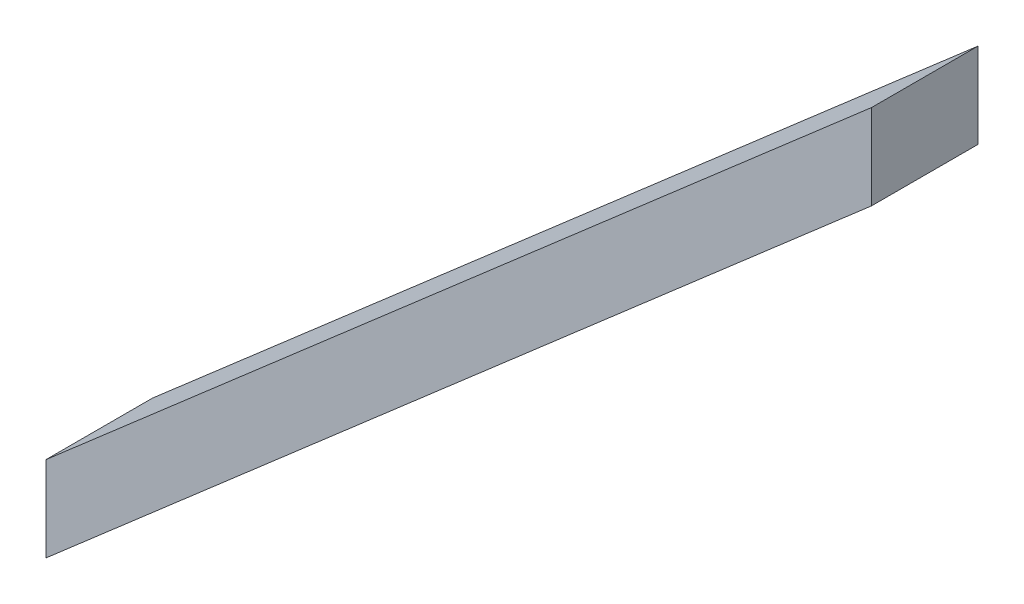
ISO-10303-21;
HEADER;
FILE_DESCRIPTION(('STEP AP214'),'2;1');
FILE_NAME('part.step','',(''),(''),'','','');
FILE_SCHEMA(('AUTOMOTIVE_DESIGN { 1 0 10303 214 1 1 1 1 }'));
ENDSEC;
DATA;
#1=APPLICATION_CONTEXT('core data for automotive mechanical design processes');
#2=APPLICATION_PROTOCOL_DEFINITION('international standard','automotive_design',2000,#1);
#3=PRODUCT_CONTEXT('',#1,'mechanical');
#4=PRODUCT('Part','Part','',(#3));
#5=PRODUCT_RELATED_PRODUCT_CATEGORY('part','',(#4));
#6=PRODUCT_DEFINITION_FORMATION('','',#4);
#7=PRODUCT_DEFINITION_CONTEXT('part definition',#1,'design');
#8=PRODUCT_DEFINITION('design','',#6,#7);
#9=PRODUCT_DEFINITION_SHAPE('','',#8);
#10=(LENGTH_UNIT() NAMED_UNIT(*) SI_UNIT(.MILLI.,.METRE.));
#11=(NAMED_UNIT(*) PLANE_ANGLE_UNIT() SI_UNIT($,.RADIAN.));
#12=(NAMED_UNIT(*) SI_UNIT($,.STERADIAN.) SOLID_ANGLE_UNIT());
#13=UNCERTAINTY_MEASURE_WITH_UNIT(LENGTH_MEASURE(1.E-05),#10,'distance_accuracy_value','');
#14=(GEOMETRIC_REPRESENTATION_CONTEXT(3) GLOBAL_UNCERTAINTY_ASSIGNED_CONTEXT((#13)) GLOBAL_UNIT_ASSIGNED_CONTEXT((#10,
#11,#12)) REPRESENTATION_CONTEXT('',''));
#15=CARTESIAN_POINT('',(0.,0.,0.));
#16=DIRECTION('',(0.,0.,1.));
#17=DIRECTION('',(1.,0.,0.));
#18=AXIS2_PLACEMENT_3D('',#15,#16,#17);
#19=CARTESIAN_POINT('',(0.,0.,63.));
#20=DIRECTION('',(-1.,0.,0.));
#21=DIRECTION('',(0.,-1.,0.));
#22=AXIS2_PLACEMENT_3D('',#19,#20,#21);
#23=PLANE('',#22);
#24=DIRECTION('',(0.,1.,0.));
#25=VECTOR('',#24,1.);
#26=CARTESIAN_POINT('',(0.,0.,0.));
#27=LINE('',#26,#25);
#28=CARTESIAN_POINT('',(0.,0.,0.));
#29=VERTEX_POINT('',#28);
#30=CARTESIAN_POINT('',(0.,50.3504937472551,0.));
#31=VERTEX_POINT('',#30);
#32=EDGE_CURVE('E97',#29,#31,#27,.T.);
#33=ORIENTED_EDGE('',*,*,#32,.F.);
#34=DIRECTION('',(0.,0.,-1.));
#35=VECTOR('',#34,1.);
#36=CARTESIAN_POINT('',(0.,0.,63.));
#37=LINE('',#36,#35);
#38=CARTESIAN_POINT('',(0.,0.,63.));
#39=VERTEX_POINT('',#38);
#40=EDGE_CURVE('E11',#39,#29,#37,.T.);
#41=ORIENTED_EDGE('',*,*,#40,.F.);
#42=DIRECTION('',(0.,1.,0.));
#43=VECTOR('',#42,1.);
#44=CARTESIAN_POINT('',(0.,0.,63.));
#45=LINE('',#44,#43);
#46=CARTESIAN_POINT('',(0.,50.3504937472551,63.));
#47=VERTEX_POINT('',#46);
#48=EDGE_CURVE('E91',#39,#47,#45,.T.);
#49=ORIENTED_EDGE('',*,*,#48,.T.);
#50=DIRECTION('',(0.,0.,-1.));
#51=VECTOR('',#50,1.);
#52=CARTESIAN_POINT('',(0.,50.3504937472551,63.));
#53=LINE('',#52,#51);
#54=EDGE_CURVE('E36',#47,#31,#53,.T.);
#55=ORIENTED_EDGE('',*,*,#54,.T.);
#56=EDGE_LOOP('',(#33,#41,#49,#55));
#57=FACE_BOUND('',#56,.T.);
#58=ADVANCED_FACE('F33',(#57),#23,.T.);
#59=CARTESIAN_POINT('',(488.,424.211928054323,63.));
#60=DIRECTION('',(0.656059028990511,-0.754709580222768,0.));
#61=DIRECTION('',(0.754709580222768,0.656059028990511,0.));
#62=AXIS2_PLACEMENT_3D('',#59,#60,#61);
#63=PLANE('',#62);
#64=DIRECTION('',(-0.754709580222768,-0.656059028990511,0.));
#65=VECTOR('',#64,1.);
#66=CARTESIAN_POINT('',(488.,424.211928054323,0.));
#67=LINE('',#66,#65);
#68=CARTESIAN_POINT('',(488.,424.211928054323,0.));
#69=VERTEX_POINT('',#68);
#70=EDGE_CURVE('E93',#69,#29,#67,.T.);
#71=ORIENTED_EDGE('',*,*,#70,.F.);
#72=DIRECTION('',(0.,0.,-1.));
#73=VECTOR('',#72,1.);
#74=CARTESIAN_POINT('',(488.,424.211928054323,63.));
#75=LINE('',#74,#73);
#76=CARTESIAN_POINT('',(488.,424.211928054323,63.));
#77=VERTEX_POINT('',#76);
#78=EDGE_CURVE('E42',#77,#69,#75,.T.);
#79=ORIENTED_EDGE('',*,*,#78,.F.);
#80=DIRECTION('',(-0.754709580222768,-0.656059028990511,0.));
#81=VECTOR('',#80,1.);
#82=CARTESIAN_POINT('',(488.,424.211928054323,63.));
#83=LINE('',#82,#81);
#84=EDGE_CURVE('E88',#77,#39,#83,.T.);
#85=ORIENTED_EDGE('',*,*,#84,.T.);
#86=ORIENTED_EDGE('',*,*,#40,.T.);
#87=EDGE_LOOP('',(#71,#79,#85,#86));
#88=FACE_BOUND('',#87,.T.);
#89=ADVANCED_FACE('F107',(#88),#63,.T.);
#90=CARTESIAN_POINT('',(488.,474.562421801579,63.));
#91=DIRECTION('',(1.,0.,0.));
#92=DIRECTION('',(0.,0.,-1.));
#93=AXIS2_PLACEMENT_3D('',#90,#91,#92);
#94=PLANE('',#93);
#95=DIRECTION('',(0.,-1.,0.));
#96=VECTOR('',#95,1.);
#97=CARTESIAN_POINT('',(488.,474.562421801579,0.));
#98=LINE('',#97,#96);
#99=CARTESIAN_POINT('',(488.,474.562421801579,0.));
#100=VERTEX_POINT('',#99);
#101=EDGE_CURVE('E83',#100,#69,#98,.T.);
#102=ORIENTED_EDGE('',*,*,#101,.F.);
#103=DIRECTION('',(0.,0.,-1.));
#104=VECTOR('',#103,1.);
#105=CARTESIAN_POINT('',(488.,474.562421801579,63.));
#106=LINE('',#105,#104);
#107=CARTESIAN_POINT('',(488.,474.562421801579,63.));
#108=VERTEX_POINT('',#107);
#109=EDGE_CURVE('E78',#108,#100,#106,.T.);
#110=ORIENTED_EDGE('',*,*,#109,.F.);
#111=DIRECTION('',(0.,-1.,0.));
#112=VECTOR('',#111,1.);
#113=CARTESIAN_POINT('',(488.,474.562421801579,63.));
#114=LINE('',#113,#112);
#115=EDGE_CURVE('E81',#108,#77,#114,.T.);
#116=ORIENTED_EDGE('',*,*,#115,.T.);
#117=ORIENTED_EDGE('',*,*,#78,.T.);
#118=EDGE_LOOP('',(#102,#110,#116,#117));
#119=FACE_BOUND('',#118,.T.);
#120=ADVANCED_FACE('F80',(#119),#94,.T.);
#121=CARTESIAN_POINT('',(0.,50.3504937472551,63.));
#122=DIRECTION('',(-0.656059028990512,0.754709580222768,0.));
#123=DIRECTION('',(-0.754709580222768,-0.656059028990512,0.));
#124=AXIS2_PLACEMENT_3D('',#121,#122,#123);
#125=PLANE('',#124);
#126=DIRECTION('',(0.754709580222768,0.656059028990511,0.));
#127=VECTOR('',#126,1.);
#128=CARTESIAN_POINT('',(0.,50.3504937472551,0.));
#129=LINE('',#128,#127);
#130=EDGE_CURVE('E100',#31,#100,#129,.T.);
#131=ORIENTED_EDGE('',*,*,#130,.F.);
#132=ORIENTED_EDGE('',*,*,#54,.F.);
#133=DIRECTION('',(0.754709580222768,0.656059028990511,0.));
#134=VECTOR('',#133,1.);
#135=CARTESIAN_POINT('',(0.,50.3504937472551,63.));
#136=LINE('',#135,#134);
#137=EDGE_CURVE('E87',#47,#108,#136,.T.);
#138=ORIENTED_EDGE('',*,*,#137,.T.);
#139=ORIENTED_EDGE('',*,*,#109,.T.);
#140=EDGE_LOOP('',(#131,#132,#138,#139));
#141=FACE_BOUND('',#140,.T.);
#142=ADVANCED_FACE('F90',(#141),#125,.T.);
#143=CARTESIAN_POINT('',(0.,0.,63.));
#144=DIRECTION('',(0.,0.,-1.));
#145=DIRECTION('',(-1.,0.,0.));
#146=AXIS2_PLACEMENT_3D('',#143,#144,#145);
#147=PLANE('',#146);
#148=ORIENTED_EDGE('',*,*,#48,.F.);
#149=ORIENTED_EDGE('',*,*,#84,.F.);
#150=ORIENTED_EDGE('',*,*,#115,.F.);
#151=ORIENTED_EDGE('',*,*,#137,.F.);
#152=EDGE_LOOP('',(#148,#149,#150,#151));
#153=FACE_BOUND('',#152,.T.);
#154=ADVANCED_FACE('F86',(#153),#147,.F.);
#155=CARTESIAN_POINT('',(0.,0.,0.));
#156=DIRECTION('',(0.,0.,-1.));
#157=DIRECTION('',(-1.,0.,0.));
#158=AXIS2_PLACEMENT_3D('',#155,#156,#157);
#159=PLANE('',#158);
#160=ORIENTED_EDGE('',*,*,#32,.T.);
#161=ORIENTED_EDGE('',*,*,#130,.T.);
#162=ORIENTED_EDGE('',*,*,#101,.T.);
#163=ORIENTED_EDGE('',*,*,#70,.T.);
#164=EDGE_LOOP('',(#160,#161,#162,#163));
#165=FACE_BOUND('',#164,.T.);
#166=ADVANCED_FACE('F106',(#165),#159,.T.);
#167=CLOSED_SHELL('',(#58,#89,#120,#142,#154,#166));
#168=MANIFOLD_SOLID_BREP('B2',#167);
#169=ADVANCED_BREP_SHAPE_REPRESENTATION('',(#18,#168),#14);
#170=SHAPE_DEFINITION_REPRESENTATION(#9,#169);
ENDSEC;
END-ISO-10303-21;
